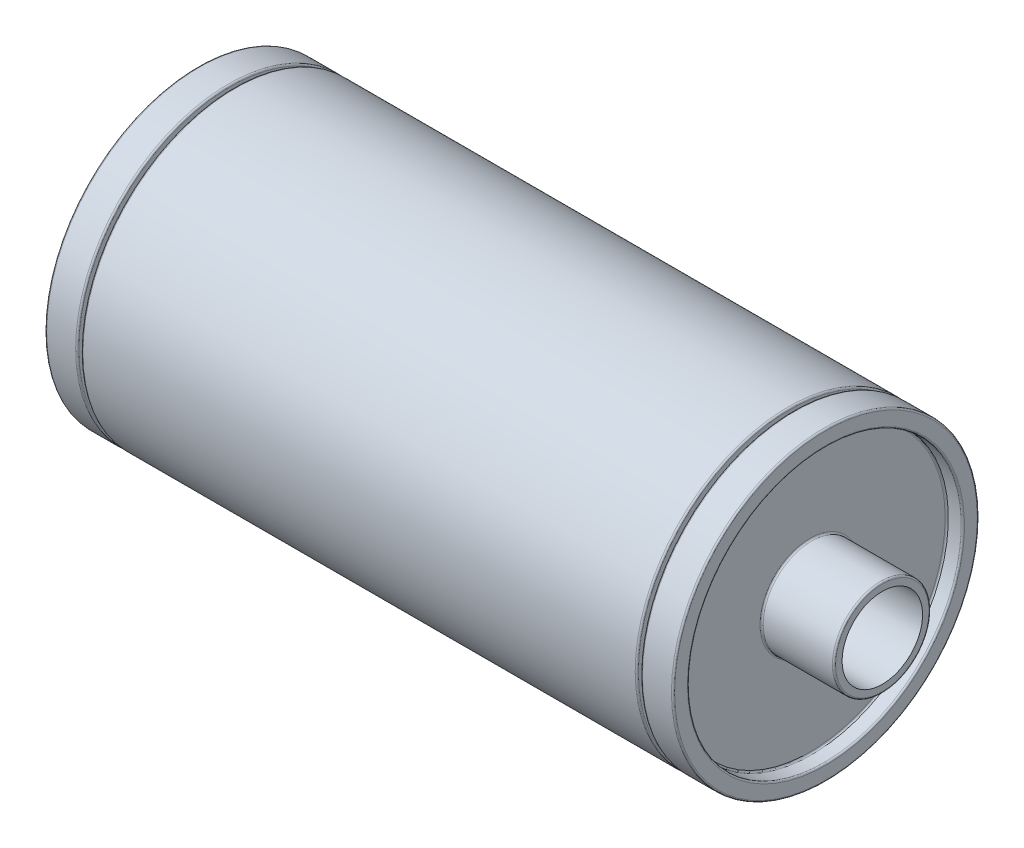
from build123d import *

# Parameters (mm, degrees)
CONG_1_R = 0.1


with BuildPart() as part:
    # Esquisse1 → R_volution1 (revolve)
    with BuildSketch(Plane.XY, mode=Mode.PRIVATE) as r_volution1_sk:
        Polygon((-23, 2.5), (23, 2.5), (23, 3), (18.5, 3), (18.5, 8.5), (19.5, 8.5), (19.5, 9.5), (17.5, 9.5), (17.5, 9), (17.25, 9), (17.25, 9.5), (-17.25, 9.5), (-17.25, 9), (-17.5, 9), (-17.5, 9.5), (-19.5, 9.5), (-19.5, 8.5), (-18.5, 8.5), (-18.5, 3), (-23, 3), align=None)
    revolve(r_volution1_sk.sketch.rotate(Axis((-72.426434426, 0, 0), (1, 0, 0)), 90), axis=Axis((-72.426434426, 0, 0), (1, 0, 0)))

    # Cong_1
    cong_1_edges = [part.edges().sort_by_distance(p)[0] for p in [
        (23, 0, -3),
        (18.5, 0, -3),
        (18.5, 0, -8.5),
        (19.5, 0, -8.5),
        (19.5, 0, -9.5),
        (17.5, 0, -9.5),
        (17.25, 0, -9.5),
        (-17.25, 0, -9.5),
        (-17.5, 0, -9.5),
        (-19.5, 0, -9.5),
        (-19.5, 0, -8.5),
        (-18.5, 0, -8.5),
        (-18.5, 0, -3),
        (-23, 0, -3),
    ]]
    fillet(cong_1_edges, radius=CONG_1_R)


solid = part.part
